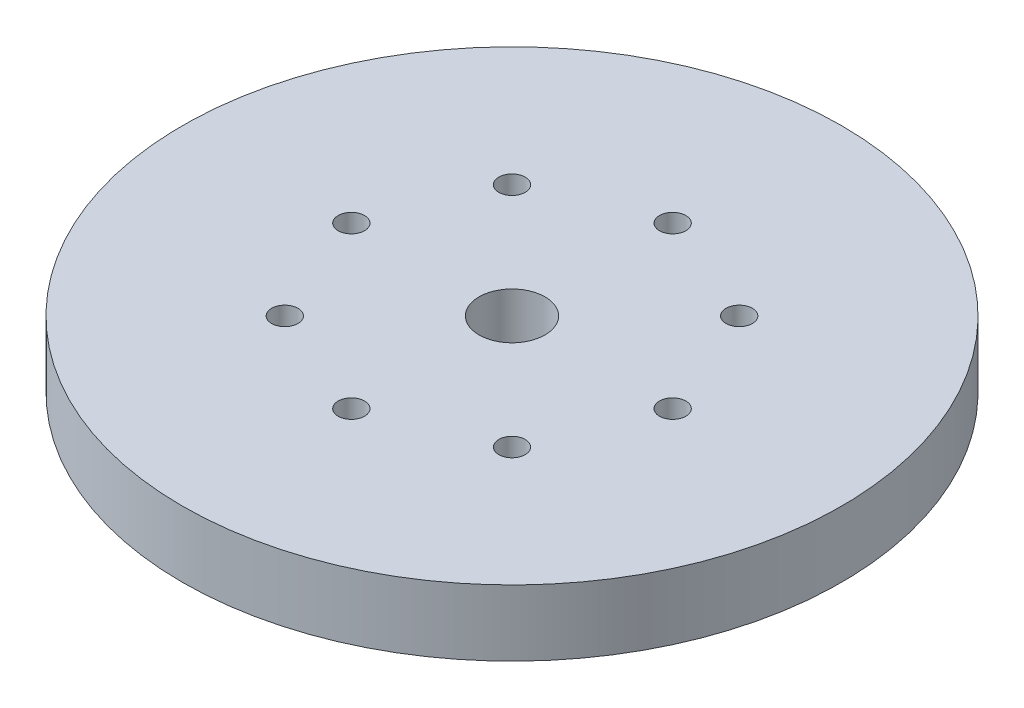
from build123d import *

# Parameters (mm, degrees)
SKETCH1_R          = 29.95
SKETCH1_R_2        = 3
EXTRUDE1_DEPTH     = 6
SKETCH3_R          = 1.2
CUT_EXTRUDE1_DEPTH = 43.778557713
CIRPATTERN1_COUNT  = 8


with BuildPart() as part:
    # Sketch1 → Extrude1 (new body)
    with BuildSketch(Plane(origin=(0, 0, 0), x_dir=(1, 0, 0), z_dir=(0, 1, 0))):
        with Locations(Location((0, 0, 0), (0, 0, 270))):
            Circle(SKETCH1_R)
        with Locations(Location((0, 0, 0), (0, 0, 270))):
            Circle(SKETCH1_R_2, mode=Mode.SUBTRACT)
    extrude(amount=EXTRUDE1_DEPTH)

    # Sketch3 → Cut-Extrude1 (cut, through all)
    with BuildSketch(Plane(origin=(0, 6, 0), x_dir=(-1, 0, 0), z_dir=(0, 1, 0))):
        with Locations(Location((0, -14.6, 0), (0, 0, 90))):
            Circle(SKETCH3_R)
    cut_extrude1 = extrude(amount=-CUT_EXTRUDE1_DEPTH, mode=Mode.SUBTRACT)

    # CirPattern1: Cut-Extrude1 ×8 about axis
    cirpattern1_axis = Axis((0, 0, 0), (0, 1, 0))
    for i in range(1, CIRPATTERN1_COUNT):
        add(cut_extrude1.rotate(cirpattern1_axis, i * 360 / CIRPATTERN1_COUNT), mode=Mode.SUBTRACT)


solid = part.part
